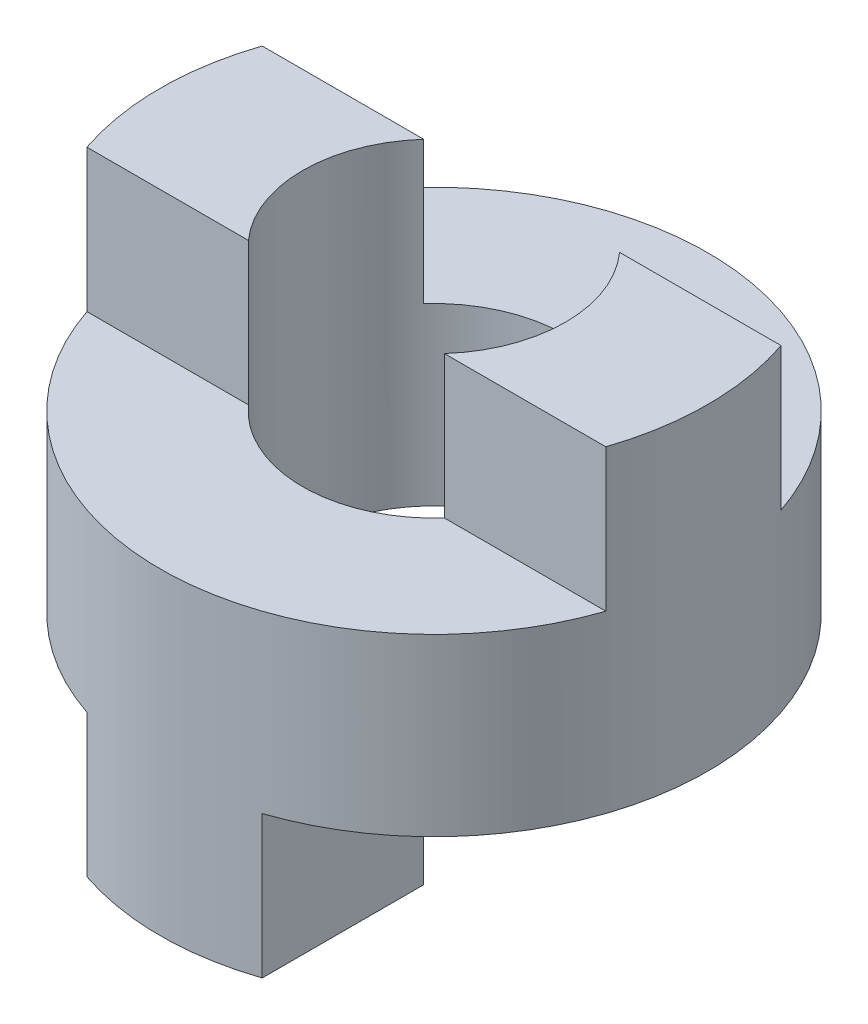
from build123d import *

# Parameters (mm, degrees)
SKETCH_1_R          = 25
SKETCH_1_R_2        = 12
EXTRUDE_1_DEPTH     = 42
SKETCH_3_W          = 22.310945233
SKETCH_3_H          = 22.947440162
CUT_EXTRUDE_2_DEPTH = 40
SKETCH_2_W          = 17
SKETCH_2_H          = 13
CUT_EXTRUDE_3_DEPTH = 40


with BuildPart() as part:
    # Sketch 1 → Extrude 1 (new body)
    with BuildSketch(Plane(origin=(0, 0, 0), x_dir=(1, 0, 0), z_dir=(0, 1, 0))):
        with Locations(Location((0, 0, 0), (0, 0, 90))):
            Circle(SKETCH_1_R)
        with Locations(Location((0, 0, 0), (0, 0, 90))):
            Circle(SKETCH_1_R_2, mode=Mode.SUBTRACT)
    extrude(amount=EXTRUDE_1_DEPTH)

    # Sketch 3 → Cut-Extrude 2 (cut, symmetric)
    with BuildSketch(Plane.XY):
        with Locations((-19.155472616, 1.526279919)):
            Rectangle(SKETCH_3_W, SKETCH_3_H)
        with Locations((19.155472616, 1.526279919)):
            Rectangle(SKETCH_3_W, SKETCH_3_H)
    extrude(amount=CUT_EXTRUDE_2_DEPTH, both=True, mode=Mode.SUBTRACT)

    # Sketch 2 → Cut-Extrude 3 (cut, symmetric)
    with BuildSketch(Plane(origin=(0, 0, 0), x_dir=(0, 0, -1), z_dir=(1, 0, 0))):
        with Locations((-16.5, 35.5)):
            Rectangle(SKETCH_2_W, SKETCH_2_H)
        with Locations((16.5, 35.5)):
            Rectangle(SKETCH_2_W, SKETCH_2_H)
    extrude(amount=CUT_EXTRUDE_3_DEPTH, both=True, mode=Mode.SUBTRACT)


solid = part.part
